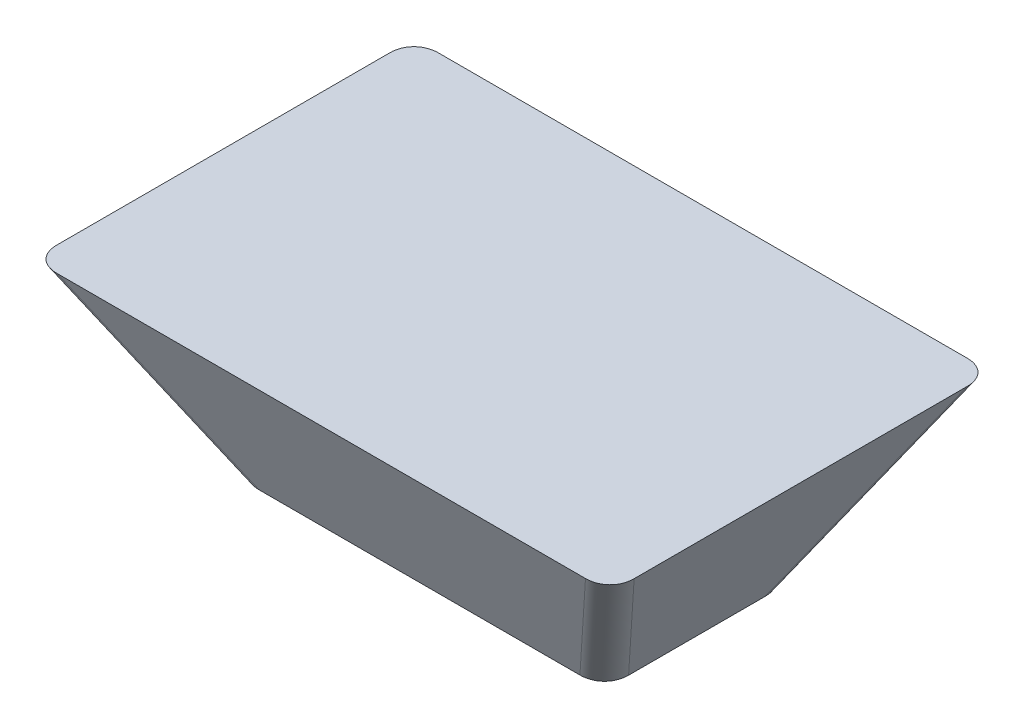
ISO-10303-21;
HEADER;
FILE_DESCRIPTION(('STEP AP214'),'2;1');
FILE_NAME('part.step','',(''),(''),'','','');
FILE_SCHEMA(('AUTOMOTIVE_DESIGN { 1 0 10303 214 1 1 1 1 }'));
ENDSEC;
DATA;
#1=APPLICATION_CONTEXT('core data for automotive mechanical design processes');
#2=APPLICATION_PROTOCOL_DEFINITION('international standard','automotive_design',2000,#1);
#3=PRODUCT_CONTEXT('',#1,'mechanical');
#4=PRODUCT('Part','Part','',(#3));
#5=PRODUCT_RELATED_PRODUCT_CATEGORY('part','',(#4));
#6=PRODUCT_DEFINITION_FORMATION('','',#4);
#7=PRODUCT_DEFINITION_CONTEXT('part definition',#1,'design');
#8=PRODUCT_DEFINITION('design','',#6,#7);
#9=PRODUCT_DEFINITION_SHAPE('','',#8);
#10=(LENGTH_UNIT() NAMED_UNIT(*) SI_UNIT(.MILLI.,.METRE.));
#11=(NAMED_UNIT(*) PLANE_ANGLE_UNIT() SI_UNIT($,.RADIAN.));
#12=(NAMED_UNIT(*) SI_UNIT($,.STERADIAN.) SOLID_ANGLE_UNIT());
#13=UNCERTAINTY_MEASURE_WITH_UNIT(LENGTH_MEASURE(1.E-05),#10,'distance_accuracy_value','');
#14=(GEOMETRIC_REPRESENTATION_CONTEXT(3) GLOBAL_UNCERTAINTY_ASSIGNED_CONTEXT((#13)) GLOBAL_UNIT_ASSIGNED_CONTEXT((#10,
#11,#12)) REPRESENTATION_CONTEXT('',''));
#15=CARTESIAN_POINT('',(0.,0.,0.));
#16=DIRECTION('',(0.,0.,1.));
#17=DIRECTION('',(1.,0.,0.));
#18=AXIS2_PLACEMENT_3D('',#15,#16,#17);
#19=CARTESIAN_POINT('',(0.,0.,0.));
#20=DIRECTION('',(0.,1.,0.));
#21=DIRECTION('',(0.,0.,1.));
#22=AXIS2_PLACEMENT_3D('',#19,#20,#21);
#23=PLANE('',#22);
#24=DIRECTION('',(0.,0.,-1.));
#25=VECTOR('',#24,1.);
#26=CARTESIAN_POINT('',(50.8,0.,25.4));
#27=LINE('',#26,#25);
#28=CARTESIAN_POINT('',(50.8,0.,18.7562949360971));
#29=VERTEX_POINT('',#28);
#30=CARTESIAN_POINT('',(50.8,0.,-18.7562949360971));
#31=VERTEX_POINT('',#30);
#32=EDGE_CURVE('E136',#29,#31,#27,.T.);
#33=ORIENTED_EDGE('',*,*,#32,.F.);
#34=CARTESIAN_POINT('',(42.0572121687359,0.,16.7669864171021));
#35=DIRECTION('',(0.,1.,0.));
#36=DIRECTION('',(-0.726207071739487,0.,-0.687476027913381));
#37=AXIS2_PLACEMENT_3D('',#34,#35,#36);
#38=ELLIPSE('',#37,9.6385093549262,7.62);
#39=CARTESIAN_POINT('',(44.0718160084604,0.,25.4));
#40=VERTEX_POINT('',#39);
#41=EDGE_CURVE('E119',#29,#40,#38,.F.);
#42=ORIENTED_EDGE('',*,*,#41,.T.);
#43=DIRECTION('',(1.,0.,0.));
#44=VECTOR('',#43,1.);
#45=CARTESIAN_POINT('',(-50.8,0.,25.4));
#46=LINE('',#45,#44);
#47=CARTESIAN_POINT('',(-44.0718160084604,0.,25.4));
#48=VERTEX_POINT('',#47);
#49=EDGE_CURVE('E147',#48,#40,#46,.T.);
#50=ORIENTED_EDGE('',*,*,#49,.F.);
#51=CARTESIAN_POINT('',(-42.0572121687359,0.,16.7669864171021));
#52=DIRECTION('',(0.,1.,0.));
#53=DIRECTION('',(0.726207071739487,0.,-0.687476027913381));
#54=AXIS2_PLACEMENT_3D('',#51,#52,#53);
#55=ELLIPSE('',#54,9.6385093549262,7.62);
#56=CARTESIAN_POINT('',(-50.8,0.,18.7562949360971));
#57=VERTEX_POINT('',#56);
#58=EDGE_CURVE('E141',#48,#57,#55,.F.);
#59=ORIENTED_EDGE('',*,*,#58,.T.);
#60=DIRECTION('',(0.,0.,1.));
#61=VECTOR('',#60,1.);
#62=CARTESIAN_POINT('',(-50.8,0.,25.4));
#63=LINE('',#62,#61);
#64=CARTESIAN_POINT('',(-50.8,0.,-18.7562949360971));
#65=VERTEX_POINT('',#64);
#66=EDGE_CURVE('E319',#65,#57,#63,.T.);
#67=ORIENTED_EDGE('',*,*,#66,.F.);
#68=CARTESIAN_POINT('',(-42.0572121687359,0.,-16.7669864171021));
#69=DIRECTION('',(0.,1.,0.));
#70=DIRECTION('',(0.726207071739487,0.,0.687476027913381));
#71=AXIS2_PLACEMENT_3D('',#68,#69,#70);
#72=ELLIPSE('',#71,9.63850935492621,7.62);
#73=CARTESIAN_POINT('',(-44.0718160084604,0.,-25.4));
#74=VERTEX_POINT('',#73);
#75=EDGE_CURVE('E197',#65,#74,#72,.F.);
#76=ORIENTED_EDGE('',*,*,#75,.T.);
#77=DIRECTION('',(-1.,0.,0.));
#78=VECTOR('',#77,1.);
#79=CARTESIAN_POINT('',(-50.8,0.,-25.4));
#80=LINE('',#79,#78);
#81=CARTESIAN_POINT('',(44.0718160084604,0.,-25.4));
#82=VERTEX_POINT('',#81);
#83=EDGE_CURVE('E146',#82,#74,#80,.T.);
#84=ORIENTED_EDGE('',*,*,#83,.F.);
#85=CARTESIAN_POINT('',(42.0572121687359,0.,-16.7669864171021));
#86=DIRECTION('',(0.,1.,0.));
#87=DIRECTION('',(-0.726207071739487,0.,0.687476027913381));
#88=AXIS2_PLACEMENT_3D('',#85,#86,#87);
#89=ELLIPSE('',#88,9.63850935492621,7.62);
#90=EDGE_CURVE('E130',#82,#31,#89,.F.);
#91=ORIENTED_EDGE('',*,*,#90,.T.);
#92=EDGE_LOOP('',(#33,#42,#50,#59,#67,#76,#84,#91));
#93=FACE_BOUND('',#92,.T.);
#94=ADVANCED_FACE('F49',(#93),#23,.F.);
#95=CARTESIAN_POINT('',(0.,50.8,0.));
#96=DIRECTION('',(0.,-1.,0.));
#97=DIRECTION('',(0.,0.,-1.));
#98=AXIS2_PLACEMENT_3D('',#95,#96,#97);
#99=PLANE('',#98);
#100=DIRECTION('',(1.,0.,0.));
#101=VECTOR('',#100,1.);
#102=CARTESIAN_POINT('',(-79.375,50.8,52.451));
#103=LINE('',#102,#101);
#104=CARTESIAN_POINT('',(-72.6468160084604,50.8,52.451));
#105=VERTEX_POINT('',#104);
#106=CARTESIAN_POINT('',(72.6468160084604,50.8,52.451));
#107=VERTEX_POINT('',#106);
#108=EDGE_CURVE('E53',#105,#107,#103,.T.);
#109=ORIENTED_EDGE('',*,*,#108,.T.);
#110=CARTESIAN_POINT('',(70.6322121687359,50.8,43.8179864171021));
#111=DIRECTION('',(0.,-1.,0.));
#112=DIRECTION('',(-0.726207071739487,0.,-0.687476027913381));
#113=AXIS2_PLACEMENT_3D('',#110,#111,#112);
#114=ELLIPSE('',#113,9.6385093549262,7.62);
#115=CARTESIAN_POINT('',(79.375,50.8,45.8072949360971));
#116=VERTEX_POINT('',#115);
#117=EDGE_CURVE('E345',#107,#116,#114,.F.);
#118=ORIENTED_EDGE('',*,*,#117,.T.);
#119=DIRECTION('',(0.,0.,-1.));
#120=VECTOR('',#119,1.);
#121=CARTESIAN_POINT('',(79.375,50.8,52.451));
#122=LINE('',#121,#120);
#123=CARTESIAN_POINT('',(79.375,50.8,-45.8072949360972));
#124=VERTEX_POINT('',#123);
#125=EDGE_CURVE('E139',#116,#124,#122,.T.);
#126=ORIENTED_EDGE('',*,*,#125,.T.);
#127=CARTESIAN_POINT('',(70.6322121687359,50.8,-43.8179864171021));
#128=DIRECTION('',(0.,-1.,0.));
#129=DIRECTION('',(-0.726207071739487,0.,0.687476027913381));
#130=AXIS2_PLACEMENT_3D('',#127,#128,#129);
#131=ELLIPSE('',#130,9.63850935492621,7.62);
#132=CARTESIAN_POINT('',(72.6468160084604,50.8,-52.451));
#133=VERTEX_POINT('',#132);
#134=EDGE_CURVE('E74',#124,#133,#131,.F.);
#135=ORIENTED_EDGE('',*,*,#134,.T.);
#136=DIRECTION('',(-1.,0.,0.));
#137=VECTOR('',#136,1.);
#138=CARTESIAN_POINT('',(-79.375,50.8,-52.451));
#139=LINE('',#138,#137);
#140=CARTESIAN_POINT('',(-72.6468160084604,50.8,-52.451));
#141=VERTEX_POINT('',#140);
#142=EDGE_CURVE('E254',#133,#141,#139,.T.);
#143=ORIENTED_EDGE('',*,*,#142,.T.);
#144=CARTESIAN_POINT('',(-70.6322121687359,50.8,-43.8179864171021));
#145=DIRECTION('',(0.,-1.,0.));
#146=DIRECTION('',(0.726207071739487,0.,0.687476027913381));
#147=AXIS2_PLACEMENT_3D('',#144,#145,#146);
#148=ELLIPSE('',#147,9.63850935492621,7.62);
#149=CARTESIAN_POINT('',(-79.375,50.8,-45.8072949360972));
#150=VERTEX_POINT('',#149);
#151=EDGE_CURVE('E352',#141,#150,#148,.F.);
#152=ORIENTED_EDGE('',*,*,#151,.T.);
#153=DIRECTION('',(0.,0.,1.));
#154=VECTOR('',#153,1.);
#155=CARTESIAN_POINT('',(-79.375,50.8,52.451));
#156=LINE('',#155,#154);
#157=CARTESIAN_POINT('',(-79.375,50.8,45.8072949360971));
#158=VERTEX_POINT('',#157);
#159=EDGE_CURVE('E326',#150,#158,#156,.T.);
#160=ORIENTED_EDGE('',*,*,#159,.T.);
#161=CARTESIAN_POINT('',(-70.6322121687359,50.8,43.8179864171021));
#162=DIRECTION('',(0.,-1.,0.));
#163=DIRECTION('',(0.726207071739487,0.,-0.687476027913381));
#164=AXIS2_PLACEMENT_3D('',#161,#162,#163);
#165=ELLIPSE('',#164,9.6385093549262,7.62);
#166=EDGE_CURVE('E263',#158,#105,#165,.F.);
#167=ORIENTED_EDGE('',*,*,#166,.T.);
#168=EDGE_LOOP('',(#109,#118,#126,#135,#143,#152,#160,#167));
#169=FACE_BOUND('',#168,.T.);
#170=ADVANCED_FACE('F171',(#169),#99,.F.);
#171=CARTESIAN_POINT('',(-38.5899109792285,-21.706824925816,0.));
#172=DIRECTION('',(-0.871575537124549,-0.490261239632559,0.));
#173=DIRECTION('',(0.490261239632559,-0.871575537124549,0.));
#174=AXIS2_PLACEMENT_3D('',#171,#172,#173);
#175=PLANE('',#174);
#176=ORIENTED_EDGE('',*,*,#159,.F.);
#177=DIRECTION('',(0.444700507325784,-0.790578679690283,0.420983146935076));
#178=VECTOR('',#177,1.);
#179=CARTESIAN_POINT('',(-37.2424735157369,-24.1022693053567,-5.9218365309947));
#180=LINE('',#179,#178);
#181=EDGE_CURVE('E12',#150,#65,#180,.T.);
#182=ORIENTED_EDGE('',*,*,#181,.T.);
#183=ORIENTED_EDGE('',*,*,#66,.T.);
#184=DIRECTION('',(0.444700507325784,-0.790578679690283,-0.420983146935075));
#185=VECTOR('',#184,1.);
#186=CARTESIAN_POINT('',(-37.2424735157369,-24.1022693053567,5.92183653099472));
#187=LINE('',#186,#185);
#188=EDGE_CURVE('E59',#57,#158,#187,.F.);
#189=ORIENTED_EDGE('',*,*,#188,.T.);
#190=EDGE_LOOP('',(#176,#182,#183,#189));
#191=FACE_BOUND('',#190,.T.);
#192=ADVANCED_FACE('F229',(#191),#175,.T.);
#193=CARTESIAN_POINT('',(0.,-10.5375202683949,19.7887704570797));
#194=DIRECTION('',(0.,-0.470015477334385,0.882658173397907));
#195=DIRECTION('',(0.,-0.882658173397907,-0.470015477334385));
#196=AXIS2_PLACEMENT_3D('',#193,#194,#195);
#197=PLANE('',#196);
#198=ORIENTED_EDGE('',*,*,#49,.T.);
#199=DIRECTION('',(-0.444700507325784,-0.790578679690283,-0.420983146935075));
#200=VECTOR('',#199,1.);
#201=CARTESIAN_POINT('',(30.6010679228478,-23.9479965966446,12.6476918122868));
#202=LINE('',#201,#200);
#203=EDGE_CURVE('E124',#40,#107,#202,.F.);
#204=ORIENTED_EDGE('',*,*,#203,.T.);
#205=ORIENTED_EDGE('',*,*,#108,.F.);
#206=DIRECTION('',(0.444700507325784,-0.790578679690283,-0.420983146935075));
#207=VECTOR('',#206,1.);
#208=CARTESIAN_POINT('',(-30.6010679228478,-23.9479965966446,12.6476918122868));
#209=LINE('',#208,#207);
#210=EDGE_CURVE('E129',#105,#48,#209,.T.);
#211=ORIENTED_EDGE('',*,*,#210,.T.);
#212=EDGE_LOOP('',(#198,#204,#205,#211));
#213=FACE_BOUND('',#212,.T.);
#214=ADVANCED_FACE('F281',(#213),#197,.T.);
#215=CARTESIAN_POINT('',(0.,-10.5375202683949,-19.7887704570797));
#216=DIRECTION('',(0.,-0.470015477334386,-0.882658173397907));
#217=DIRECTION('',(0.,0.882658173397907,-0.470015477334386));
#218=AXIS2_PLACEMENT_3D('',#215,#216,#217);
#219=PLANE('',#218);
#220=ORIENTED_EDGE('',*,*,#142,.F.);
#221=DIRECTION('',(-0.444700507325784,-0.790578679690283,0.420983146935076));
#222=VECTOR('',#221,1.);
#223=CARTESIAN_POINT('',(30.6010679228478,-23.9479965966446,-12.6476918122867));
#224=LINE('',#223,#222);
#225=EDGE_CURVE('E338',#133,#82,#224,.T.);
#226=ORIENTED_EDGE('',*,*,#225,.T.);
#227=ORIENTED_EDGE('',*,*,#83,.T.);
#228=DIRECTION('',(0.444700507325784,-0.790578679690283,0.420983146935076));
#229=VECTOR('',#228,1.);
#230=CARTESIAN_POINT('',(-30.6010679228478,-23.9479965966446,-12.6476918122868));
#231=LINE('',#230,#229);
#232=EDGE_CURVE('E67',#74,#141,#231,.F.);
#233=ORIENTED_EDGE('',*,*,#232,.T.);
#234=EDGE_LOOP('',(#220,#226,#227,#233));
#235=FACE_BOUND('',#234,.T.);
#236=ADVANCED_FACE('F273',(#235),#219,.T.);
#237=CARTESIAN_POINT('',(38.5899109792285,-21.706824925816,0.));
#238=DIRECTION('',(0.871575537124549,-0.490261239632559,0.));
#239=DIRECTION('',(0.490261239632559,0.871575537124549,0.));
#240=AXIS2_PLACEMENT_3D('',#237,#238,#239);
#241=PLANE('',#240);
#242=ORIENTED_EDGE('',*,*,#125,.F.);
#243=DIRECTION('',(-0.444700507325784,-0.790578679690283,-0.420983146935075));
#244=VECTOR('',#243,1.);
#245=CARTESIAN_POINT('',(37.2424735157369,-24.1022693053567,5.9218365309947));
#246=LINE('',#245,#244);
#247=EDGE_CURVE('E123',#116,#29,#246,.T.);
#248=ORIENTED_EDGE('',*,*,#247,.T.);
#249=ORIENTED_EDGE('',*,*,#32,.T.);
#250=DIRECTION('',(-0.444700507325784,-0.790578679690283,0.420983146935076));
#251=VECTOR('',#250,1.);
#252=CARTESIAN_POINT('',(37.2424735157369,-24.1022693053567,-5.9218365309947));
#253=LINE('',#252,#251);
#254=EDGE_CURVE('E142',#31,#124,#253,.F.);
#255=ORIENTED_EDGE('',*,*,#254,.T.);
#256=EDGE_LOOP('',(#242,#248,#249,#255));
#257=FACE_BOUND('',#256,.T.);
#258=ADVANCED_FACE('F135',(#257),#241,.T.);
#259=CARTESIAN_POINT('',(30.6010679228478,-20.3664786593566,5.92183653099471));
#260=DIRECTION('',(-0.444700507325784,-0.790578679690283,-0.420983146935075));
#261=DIRECTION('',(0.871575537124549,-0.490261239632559,0.));
#262=AXIS2_PLACEMENT_3D('',#259,#260,#261);
#263=CYLINDRICAL_SURFACE('',#262,7.62);
#264=ORIENTED_EDGE('',*,*,#117,.F.);
#265=ORIENTED_EDGE('',*,*,#203,.F.);
#266=ORIENTED_EDGE('',*,*,#41,.F.);
#267=ORIENTED_EDGE('',*,*,#247,.F.);
#268=EDGE_LOOP('',(#264,#265,#266,#267));
#269=FACE_BOUND('',#268,.T.);
#270=ADVANCED_FACE('F122',(#269),#263,.T.);
#271=CARTESIAN_POINT('',(30.6010679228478,-20.3664786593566,-5.9218365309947));
#272=DIRECTION('',(-0.444700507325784,-0.790578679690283,0.420983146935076));
#273=DIRECTION('',(0.871575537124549,-0.490261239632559,0.));
#274=AXIS2_PLACEMENT_3D('',#271,#272,#273);
#275=CYLINDRICAL_SURFACE('',#274,7.62);
#276=ORIENTED_EDGE('',*,*,#134,.F.);
#277=ORIENTED_EDGE('',*,*,#254,.F.);
#278=ORIENTED_EDGE('',*,*,#90,.F.);
#279=ORIENTED_EDGE('',*,*,#225,.F.);
#280=EDGE_LOOP('',(#276,#277,#278,#279));
#281=FACE_BOUND('',#280,.T.);
#282=ADVANCED_FACE('F367',(#281),#275,.T.);
#283=CARTESIAN_POINT('',(-30.6010679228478,-20.3664786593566,-5.9218365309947));
#284=DIRECTION('',(0.444700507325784,-0.790578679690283,0.420983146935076));
#285=DIRECTION('',(0.871575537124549,0.490261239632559,0.));
#286=AXIS2_PLACEMENT_3D('',#283,#284,#285);
#287=CYLINDRICAL_SURFACE('',#286,7.62);
#288=ORIENTED_EDGE('',*,*,#151,.F.);
#289=ORIENTED_EDGE('',*,*,#232,.F.);
#290=ORIENTED_EDGE('',*,*,#75,.F.);
#291=ORIENTED_EDGE('',*,*,#181,.F.);
#292=EDGE_LOOP('',(#288,#289,#290,#291));
#293=FACE_BOUND('',#292,.T.);
#294=ADVANCED_FACE('F365',(#293),#287,.T.);
#295=CARTESIAN_POINT('',(-30.6010679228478,-20.3664786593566,5.92183653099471));
#296=DIRECTION('',(0.444700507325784,-0.790578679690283,-0.420983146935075));
#297=DIRECTION('',(0.871575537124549,0.490261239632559,0.));
#298=AXIS2_PLACEMENT_3D('',#295,#296,#297);
#299=CYLINDRICAL_SURFACE('',#298,7.62);
#300=ORIENTED_EDGE('',*,*,#166,.F.);
#301=ORIENTED_EDGE('',*,*,#188,.F.);
#302=ORIENTED_EDGE('',*,*,#58,.F.);
#303=ORIENTED_EDGE('',*,*,#210,.F.);
#304=EDGE_LOOP('',(#300,#301,#302,#303));
#305=FACE_BOUND('',#304,.T.);
#306=ADVANCED_FACE('F51',(#305),#299,.T.);
#307=CLOSED_SHELL('',(#94,#170,#192,#214,#236,#258,#270,#282,#294,#306));
#308=MANIFOLD_SOLID_BREP('B2',#307);
#309=ADVANCED_BREP_SHAPE_REPRESENTATION('',(#18,#308),#14);
#310=SHAPE_DEFINITION_REPRESENTATION(#9,#309);
ENDSEC;
END-ISO-10303-21;
